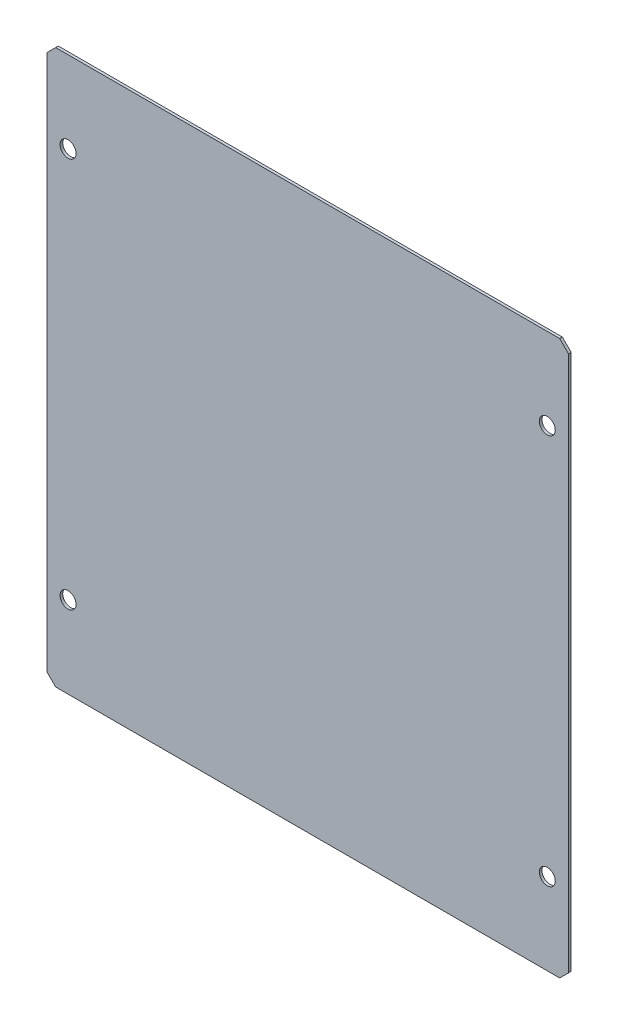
ISO-10303-21;
HEADER;
FILE_DESCRIPTION(('STEP AP214'),'2;1');
FILE_NAME('part.step','',(''),(''),'','','');
FILE_SCHEMA(('AUTOMOTIVE_DESIGN { 1 0 10303 214 1 1 1 1 }'));
ENDSEC;
DATA;
#1=APPLICATION_CONTEXT('core data for automotive mechanical design processes');
#2=APPLICATION_PROTOCOL_DEFINITION('international standard','automotive_design',2000,#1);
#3=PRODUCT_CONTEXT('',#1,'mechanical');
#4=PRODUCT('Part','Part','',(#3));
#5=PRODUCT_RELATED_PRODUCT_CATEGORY('part','',(#4));
#6=PRODUCT_DEFINITION_FORMATION('','',#4);
#7=PRODUCT_DEFINITION_CONTEXT('part definition',#1,'design');
#8=PRODUCT_DEFINITION('design','',#6,#7);
#9=PRODUCT_DEFINITION_SHAPE('','',#8);
#10=(LENGTH_UNIT() NAMED_UNIT(*) SI_UNIT(.MILLI.,.METRE.));
#11=(NAMED_UNIT(*) PLANE_ANGLE_UNIT() SI_UNIT($,.RADIAN.));
#12=(NAMED_UNIT(*) SI_UNIT($,.STERADIAN.) SOLID_ANGLE_UNIT());
#13=UNCERTAINTY_MEASURE_WITH_UNIT(LENGTH_MEASURE(1.E-05),#10,'distance_accuracy_value','');
#14=(GEOMETRIC_REPRESENTATION_CONTEXT(3) GLOBAL_UNCERTAINTY_ASSIGNED_CONTEXT((#13)) GLOBAL_UNIT_ASSIGNED_CONTEXT((#10,
#11,#12)) REPRESENTATION_CONTEXT('',''));
#15=CARTESIAN_POINT('',(0.,0.,0.));
#16=DIRECTION('',(0.,0.,1.));
#17=DIRECTION('',(1.,0.,0.));
#18=AXIS2_PLACEMENT_3D('',#15,#16,#17);
#19=CARTESIAN_POINT('',(0.,0.,1.5));
#20=DIRECTION('',(1.,0.,0.));
#21=DIRECTION('',(0.,0.,-1.));
#22=AXIS2_PLACEMENT_3D('',#19,#20,#21);
#23=PLANE('',#22);
#24=DIRECTION('',(0.,-1.,0.));
#25=VECTOR('',#24,1.);
#26=CARTESIAN_POINT('',(0.,0.,0.));
#27=LINE('',#26,#25);
#28=CARTESIAN_POINT('',(0.,307.,0.));
#29=VERTEX_POINT('',#28);
#30=CARTESIAN_POINT('',(0.,5.,0.));
#31=VERTEX_POINT('',#30);
#32=EDGE_CURVE('E133',#29,#31,#27,.T.);
#33=ORIENTED_EDGE('',*,*,#32,.T.);
#34=DIRECTION('',(0.,0.,1.));
#35=VECTOR('',#34,1.);
#36=CARTESIAN_POINT('',(0.,5.,1.5));
#37=LINE('',#36,#35);
#38=CARTESIAN_POINT('',(0.,5.,1.5));
#39=VERTEX_POINT('',#38);
#40=EDGE_CURVE('E11',#31,#39,#37,.T.);
#41=ORIENTED_EDGE('',*,*,#40,.T.);
#42=DIRECTION('',(0.,-1.,0.));
#43=VECTOR('',#42,1.);
#44=CARTESIAN_POINT('',(0.,0.,1.5));
#45=LINE('',#44,#43);
#46=CARTESIAN_POINT('',(0.,307.,1.5));
#47=VERTEX_POINT('',#46);
#48=EDGE_CURVE('E131',#47,#39,#45,.T.);
#49=ORIENTED_EDGE('',*,*,#48,.F.);
#50=DIRECTION('',(0.,0.,-1.));
#51=VECTOR('',#50,1.);
#52=CARTESIAN_POINT('',(0.,307.,1.5));
#53=LINE('',#52,#51);
#54=EDGE_CURVE('E45',#47,#29,#53,.T.);
#55=ORIENTED_EDGE('',*,*,#54,.T.);
#56=EDGE_LOOP('',(#33,#41,#49,#55));
#57=FACE_BOUND('',#56,.T.);
#58=ADVANCED_FACE('F37',(#57),#23,.F.);
#59=CARTESIAN_POINT('',(0.,0.,1.5));
#60=DIRECTION('',(0.,1.,0.));
#61=DIRECTION('',(0.,0.,1.));
#62=AXIS2_PLACEMENT_3D('',#59,#60,#61);
#63=PLANE('',#62);
#64=DIRECTION('',(1.,0.,0.));
#65=VECTOR('',#64,1.);
#66=CARTESIAN_POINT('',(0.,0.,0.));
#67=LINE('',#66,#65);
#68=CARTESIAN_POINT('',(5.,0.,0.));
#69=VERTEX_POINT('',#68);
#70=CARTESIAN_POINT('',(289.,0.,0.));
#71=VERTEX_POINT('',#70);
#72=EDGE_CURVE('E129',#69,#71,#67,.T.);
#73=ORIENTED_EDGE('',*,*,#72,.T.);
#74=DIRECTION('',(0.,0.,1.));
#75=VECTOR('',#74,1.);
#76=CARTESIAN_POINT('',(289.,0.,1.5));
#77=LINE('',#76,#75);
#78=CARTESIAN_POINT('',(289.,0.,1.5));
#79=VERTEX_POINT('',#78);
#80=EDGE_CURVE('E108',#71,#79,#77,.T.);
#81=ORIENTED_EDGE('',*,*,#80,.T.);
#82=DIRECTION('',(1.,0.,0.));
#83=VECTOR('',#82,1.);
#84=CARTESIAN_POINT('',(0.,0.,1.5));
#85=LINE('',#84,#83);
#86=CARTESIAN_POINT('',(5.,0.,1.5));
#87=VERTEX_POINT('',#86);
#88=EDGE_CURVE('E173',#87,#79,#85,.T.);
#89=ORIENTED_EDGE('',*,*,#88,.F.);
#90=DIRECTION('',(0.,0.,-1.));
#91=VECTOR('',#90,1.);
#92=CARTESIAN_POINT('',(5.,0.,1.5));
#93=LINE('',#92,#91);
#94=EDGE_CURVE('E113',#87,#69,#93,.T.);
#95=ORIENTED_EDGE('',*,*,#94,.T.);
#96=EDGE_LOOP('',(#73,#81,#89,#95));
#97=FACE_BOUND('',#96,.T.);
#98=ADVANCED_FACE('F221',(#97),#63,.F.);
#99=CARTESIAN_POINT('',(294.,0.,1.5));
#100=DIRECTION('',(-1.,0.,0.));
#101=DIRECTION('',(0.,0.,1.));
#102=AXIS2_PLACEMENT_3D('',#99,#100,#101);
#103=PLANE('',#102);
#104=DIRECTION('',(0.,1.,0.));
#105=VECTOR('',#104,1.);
#106=CARTESIAN_POINT('',(294.,0.,1.5));
#107=LINE('',#106,#105);
#108=CARTESIAN_POINT('',(294.,5.,1.5));
#109=VERTEX_POINT('',#108);
#110=CARTESIAN_POINT('',(294.,307.,1.5));
#111=VERTEX_POINT('',#110);
#112=EDGE_CURVE('E122',#109,#111,#107,.T.);
#113=ORIENTED_EDGE('',*,*,#112,.F.);
#114=DIRECTION('',(0.,0.,-1.));
#115=VECTOR('',#114,1.);
#116=CARTESIAN_POINT('',(294.,5.,1.5));
#117=LINE('',#116,#115);
#118=CARTESIAN_POINT('',(294.,5.,0.));
#119=VERTEX_POINT('',#118);
#120=EDGE_CURVE('E107',#109,#119,#117,.T.);
#121=ORIENTED_EDGE('',*,*,#120,.T.);
#122=DIRECTION('',(0.,1.,0.));
#123=VECTOR('',#122,1.);
#124=CARTESIAN_POINT('',(294.,0.,0.));
#125=LINE('',#124,#123);
#126=CARTESIAN_POINT('',(294.,307.,0.));
#127=VERTEX_POINT('',#126);
#128=EDGE_CURVE('E120',#119,#127,#125,.T.);
#129=ORIENTED_EDGE('',*,*,#128,.T.);
#130=DIRECTION('',(0.,0.,1.));
#131=VECTOR('',#130,1.);
#132=CARTESIAN_POINT('',(294.,307.,1.5));
#133=LINE('',#132,#131);
#134=EDGE_CURVE('E124',#127,#111,#133,.T.);
#135=ORIENTED_EDGE('',*,*,#134,.T.);
#136=EDGE_LOOP('',(#113,#121,#129,#135));
#137=FACE_BOUND('',#136,.T.);
#138=ADVANCED_FACE('F119',(#137),#103,.F.);
#139=CARTESIAN_POINT('',(0.,312.,1.5));
#140=DIRECTION('',(0.,-1.,0.));
#141=DIRECTION('',(0.,0.,-1.));
#142=AXIS2_PLACEMENT_3D('',#139,#140,#141);
#143=PLANE('',#142);
#144=DIRECTION('',(-1.,0.,0.));
#145=VECTOR('',#144,1.);
#146=CARTESIAN_POINT('',(0.,312.,1.5));
#147=LINE('',#146,#145);
#148=CARTESIAN_POINT('',(289.,312.,1.5));
#149=VERTEX_POINT('',#148);
#150=CARTESIAN_POINT('',(4.99999999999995,312.,1.5));
#151=VERTEX_POINT('',#150);
#152=EDGE_CURVE('E141',#149,#151,#147,.T.);
#153=ORIENTED_EDGE('',*,*,#152,.F.);
#154=DIRECTION('',(0.,0.,-1.));
#155=VECTOR('',#154,1.);
#156=CARTESIAN_POINT('',(289.,312.,1.5));
#157=LINE('',#156,#155);
#158=CARTESIAN_POINT('',(289.,312.,0.));
#159=VERTEX_POINT('',#158);
#160=EDGE_CURVE('E158',#149,#159,#157,.T.);
#161=ORIENTED_EDGE('',*,*,#160,.T.);
#162=DIRECTION('',(-1.,0.,0.));
#163=VECTOR('',#162,1.);
#164=CARTESIAN_POINT('',(0.,312.,0.));
#165=LINE('',#164,#163);
#166=CARTESIAN_POINT('',(4.99999999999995,312.,0.));
#167=VERTEX_POINT('',#166);
#168=EDGE_CURVE('E128',#159,#167,#165,.T.);
#169=ORIENTED_EDGE('',*,*,#168,.T.);
#170=DIRECTION('',(0.,0.,1.));
#171=VECTOR('',#170,1.);
#172=CARTESIAN_POINT('',(4.99999999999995,312.,1.5));
#173=LINE('',#172,#171);
#174=EDGE_CURVE('E52',#167,#151,#173,.T.);
#175=ORIENTED_EDGE('',*,*,#174,.T.);
#176=EDGE_LOOP('',(#153,#161,#169,#175));
#177=FACE_BOUND('',#176,.T.);
#178=ADVANCED_FACE('F210',(#177),#143,.F.);
#179=CARTESIAN_POINT('',(0.,0.,1.5));
#180=DIRECTION('',(0.,0.,-1.));
#181=DIRECTION('',(-1.,0.,0.));
#182=AXIS2_PLACEMENT_3D('',#179,#180,#181);
#183=PLANE('',#182);
#184=CARTESIAN_POINT('',(12.,266.,1.5));
#185=DIRECTION('',(0.,0.,-1.));
#186=DIRECTION('',(-1.,0.,0.));
#187=AXIS2_PLACEMENT_3D('',#184,#185,#186);
#188=CIRCLE('',#187,4.5);
#189=CARTESIAN_POINT('',(7.49999999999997,266.,1.5));
#190=VERTEX_POINT('',#189);
#191=EDGE_CURVE('E191',#190,#190,#188,.T.);
#192=ORIENTED_EDGE('',*,*,#191,.T.);
#193=EDGE_LOOP('',(#192));
#194=FACE_BOUND('',#193,.T.);
#195=CARTESIAN_POINT('',(12.,46.,1.5));
#196=DIRECTION('',(0.,0.,-1.));
#197=DIRECTION('',(-1.,0.,0.));
#198=AXIS2_PLACEMENT_3D('',#195,#196,#197);
#199=CIRCLE('',#198,4.5);
#200=CARTESIAN_POINT('',(7.49999999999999,46.,1.5));
#201=VERTEX_POINT('',#200);
#202=EDGE_CURVE('E185',#201,#201,#199,.T.);
#203=ORIENTED_EDGE('',*,*,#202,.T.);
#204=EDGE_LOOP('',(#203));
#205=FACE_BOUND('',#204,.T.);
#206=CARTESIAN_POINT('',(282.,266.,1.5));
#207=DIRECTION('',(0.,0.,-1.));
#208=DIRECTION('',(-1.,0.,0.));
#209=AXIS2_PLACEMENT_3D('',#206,#207,#208);
#210=CIRCLE('',#209,4.5);
#211=CARTESIAN_POINT('',(277.5,266.,1.5));
#212=VERTEX_POINT('',#211);
#213=EDGE_CURVE('E179',#212,#212,#210,.T.);
#214=ORIENTED_EDGE('',*,*,#213,.T.);
#215=EDGE_LOOP('',(#214));
#216=FACE_BOUND('',#215,.T.);
#217=CARTESIAN_POINT('',(282.,46.,1.5));
#218=DIRECTION('',(0.,0.,-1.));
#219=DIRECTION('',(-1.,0.,0.));
#220=AXIS2_PLACEMENT_3D('',#217,#218,#219);
#221=CIRCLE('',#220,4.5);
#222=CARTESIAN_POINT('',(277.5,46.,1.5));
#223=VERTEX_POINT('',#222);
#224=EDGE_CURVE('E137',#223,#223,#221,.T.);
#225=ORIENTED_EDGE('',*,*,#224,.T.);
#226=EDGE_LOOP('',(#225));
#227=FACE_BOUND('',#226,.T.);
#228=ORIENTED_EDGE('',*,*,#88,.T.);
#229=DIRECTION('',(-0.707106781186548,-0.707106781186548,0.));
#230=VECTOR('',#229,1.);
#231=CARTESIAN_POINT('',(294.,5.,1.5));
#232=LINE('',#231,#230);
#233=EDGE_CURVE('E155',#79,#109,#232,.F.);
#234=ORIENTED_EDGE('',*,*,#233,.T.);
#235=ORIENTED_EDGE('',*,*,#112,.T.);
#236=DIRECTION('',(0.707106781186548,-0.707106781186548,0.));
#237=VECTOR('',#236,1.);
#238=CARTESIAN_POINT('',(289.,312.,1.5));
#239=LINE('',#238,#237);
#240=EDGE_CURVE('E59',#111,#149,#239,.F.);
#241=ORIENTED_EDGE('',*,*,#240,.T.);
#242=ORIENTED_EDGE('',*,*,#152,.T.);
#243=DIRECTION('',(0.707106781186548,0.707106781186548,0.));
#244=VECTOR('',#243,1.);
#245=CARTESIAN_POINT('',(0.,307.,1.5));
#246=LINE('',#245,#244);
#247=EDGE_CURVE('E150',#151,#47,#246,.F.);
#248=ORIENTED_EDGE('',*,*,#247,.T.);
#249=ORIENTED_EDGE('',*,*,#48,.T.);
#250=DIRECTION('',(-0.707106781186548,0.707106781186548,0.));
#251=VECTOR('',#250,1.);
#252=CARTESIAN_POINT('',(5.,0.,1.5));
#253=LINE('',#252,#251);
#254=EDGE_CURVE('E152',#39,#87,#253,.F.);
#255=ORIENTED_EDGE('',*,*,#254,.T.);
#256=EDGE_LOOP('',(#228,#234,#235,#241,#242,#248,#249,#255));
#257=FACE_BOUND('',#256,.T.);
#258=ADVANCED_FACE('F207',(#194,#205,#216,#227,#257),#183,.F.);
#259=CARTESIAN_POINT('',(0.,0.,0.));
#260=DIRECTION('',(0.,0.,-1.));
#261=DIRECTION('',(-1.,0.,0.));
#262=AXIS2_PLACEMENT_3D('',#259,#260,#261);
#263=PLANE('',#262);
#264=CARTESIAN_POINT('',(12.,266.,0.));
#265=DIRECTION('',(0.,0.,1.));
#266=DIRECTION('',(1.,0.,0.));
#267=AXIS2_PLACEMENT_3D('',#264,#265,#266);
#268=CIRCLE('',#267,4.5);
#269=CARTESIAN_POINT('',(16.5,266.,0.));
#270=VERTEX_POINT('',#269);
#271=EDGE_CURVE('E194',#270,#270,#268,.T.);
#272=ORIENTED_EDGE('',*,*,#271,.T.);
#273=EDGE_LOOP('',(#272));
#274=FACE_BOUND('',#273,.T.);
#275=CARTESIAN_POINT('',(12.,46.,0.));
#276=DIRECTION('',(0.,0.,1.));
#277=DIRECTION('',(1.,0.,0.));
#278=AXIS2_PLACEMENT_3D('',#275,#276,#277);
#279=CIRCLE('',#278,4.5);
#280=CARTESIAN_POINT('',(16.5,46.,0.));
#281=VERTEX_POINT('',#280);
#282=EDGE_CURVE('E188',#281,#281,#279,.T.);
#283=ORIENTED_EDGE('',*,*,#282,.T.);
#284=EDGE_LOOP('',(#283));
#285=FACE_BOUND('',#284,.T.);
#286=CARTESIAN_POINT('',(282.,266.,0.));
#287=DIRECTION('',(0.,0.,1.));
#288=DIRECTION('',(1.,0.,0.));
#289=AXIS2_PLACEMENT_3D('',#286,#287,#288);
#290=CIRCLE('',#289,4.5);
#291=CARTESIAN_POINT('',(286.5,266.,0.));
#292=VERTEX_POINT('',#291);
#293=EDGE_CURVE('E182',#292,#292,#290,.T.);
#294=ORIENTED_EDGE('',*,*,#293,.T.);
#295=EDGE_LOOP('',(#294));
#296=FACE_BOUND('',#295,.T.);
#297=CARTESIAN_POINT('',(282.,46.,0.));
#298=DIRECTION('',(0.,0.,1.));
#299=DIRECTION('',(1.,0.,0.));
#300=AXIS2_PLACEMENT_3D('',#297,#298,#299);
#301=CIRCLE('',#300,4.5);
#302=CARTESIAN_POINT('',(286.5,46.,0.));
#303=VERTEX_POINT('',#302);
#304=EDGE_CURVE('E140',#303,#303,#301,.T.);
#305=ORIENTED_EDGE('',*,*,#304,.T.);
#306=EDGE_LOOP('',(#305));
#307=FACE_BOUND('',#306,.T.);
#308=ORIENTED_EDGE('',*,*,#128,.F.);
#309=DIRECTION('',(0.707106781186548,0.707106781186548,0.));
#310=VECTOR('',#309,1.);
#311=CARTESIAN_POINT('',(144.5,-144.5,0.));
#312=LINE('',#311,#310);
#313=EDGE_CURVE('E103',#119,#71,#312,.F.);
#314=ORIENTED_EDGE('',*,*,#313,.T.);
#315=ORIENTED_EDGE('',*,*,#72,.F.);
#316=DIRECTION('',(0.707106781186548,-0.707106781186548,0.));
#317=VECTOR('',#316,1.);
#318=CARTESIAN_POINT('',(2.5,2.5,0.));
#319=LINE('',#318,#317);
#320=EDGE_CURVE('E144',#69,#31,#319,.F.);
#321=ORIENTED_EDGE('',*,*,#320,.T.);
#322=ORIENTED_EDGE('',*,*,#32,.F.);
#323=DIRECTION('',(-0.707106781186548,-0.707106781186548,0.));
#324=VECTOR('',#323,1.);
#325=CARTESIAN_POINT('',(-153.5,153.5,0.));
#326=LINE('',#325,#324);
#327=EDGE_CURVE('E123',#29,#167,#326,.F.);
#328=ORIENTED_EDGE('',*,*,#327,.T.);
#329=ORIENTED_EDGE('',*,*,#168,.F.);
#330=DIRECTION('',(-0.707106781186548,0.707106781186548,0.));
#331=VECTOR('',#330,1.);
#332=CARTESIAN_POINT('',(300.5,300.5,0.));
#333=LINE('',#332,#331);
#334=EDGE_CURVE('E114',#159,#127,#333,.F.);
#335=ORIENTED_EDGE('',*,*,#334,.T.);
#336=EDGE_LOOP('',(#308,#314,#315,#321,#322,#328,#329,#335));
#337=FACE_BOUND('',#336,.T.);
#338=ADVANCED_FACE('F126',(#274,#285,#296,#307,#337),#263,.T.);
#339=CARTESIAN_POINT('',(282.,46.,1.5));
#340=DIRECTION('',(0.,0.,1.));
#341=DIRECTION('',(1.,0.,0.));
#342=AXIS2_PLACEMENT_3D('',#339,#340,#341);
#343=CYLINDRICAL_SURFACE('',#342,4.5);
#344=ORIENTED_EDGE('',*,*,#304,.F.);
#345=EDGE_LOOP('',(#344));
#346=FACE_BOUND('',#345,.T.);
#347=ORIENTED_EDGE('',*,*,#224,.F.);
#348=EDGE_LOOP('',(#347));
#349=FACE_BOUND('',#348,.T.);
#350=ADVANCED_FACE('F251',(#346,#349),#343,.F.);
#351=CARTESIAN_POINT('',(282.,266.,1.5));
#352=DIRECTION('',(0.,0.,1.));
#353=DIRECTION('',(1.,0.,0.));
#354=AXIS2_PLACEMENT_3D('',#351,#352,#353);
#355=CYLINDRICAL_SURFACE('',#354,4.5);
#356=ORIENTED_EDGE('',*,*,#293,.F.);
#357=EDGE_LOOP('',(#356));
#358=FACE_BOUND('',#357,.T.);
#359=ORIENTED_EDGE('',*,*,#213,.F.);
#360=EDGE_LOOP('',(#359));
#361=FACE_BOUND('',#360,.T.);
#362=ADVANCED_FACE('F255',(#358,#361),#355,.F.);
#363=CARTESIAN_POINT('',(12.,46.,1.5));
#364=DIRECTION('',(0.,0.,1.));
#365=DIRECTION('',(1.,0.,0.));
#366=AXIS2_PLACEMENT_3D('',#363,#364,#365);
#367=CYLINDRICAL_SURFACE('',#366,4.5);
#368=ORIENTED_EDGE('',*,*,#282,.F.);
#369=EDGE_LOOP('',(#368));
#370=FACE_BOUND('',#369,.T.);
#371=ORIENTED_EDGE('',*,*,#202,.F.);
#372=EDGE_LOOP('',(#371));
#373=FACE_BOUND('',#372,.T.);
#374=ADVANCED_FACE('F203',(#370,#373),#367,.F.);
#375=CARTESIAN_POINT('',(12.,266.,1.5));
#376=DIRECTION('',(0.,0.,1.));
#377=DIRECTION('',(1.,0.,0.));
#378=AXIS2_PLACEMENT_3D('',#375,#376,#377);
#379=CYLINDRICAL_SURFACE('',#378,4.5);
#380=ORIENTED_EDGE('',*,*,#271,.F.);
#381=EDGE_LOOP('',(#380));
#382=FACE_BOUND('',#381,.T.);
#383=ORIENTED_EDGE('',*,*,#191,.F.);
#384=EDGE_LOOP('',(#383));
#385=FACE_BOUND('',#384,.T.);
#386=ADVANCED_FACE('F200',(#382,#385),#379,.F.);
#387=CARTESIAN_POINT('',(294.,5.,1.5));
#388=DIRECTION('',(-0.707106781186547,0.707106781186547,0.));
#389=DIRECTION('',(0.,0.,-1.));
#390=AXIS2_PLACEMENT_3D('',#387,#388,#389);
#391=PLANE('',#390);
#392=ORIENTED_EDGE('',*,*,#233,.F.);
#393=ORIENTED_EDGE('',*,*,#80,.F.);
#394=ORIENTED_EDGE('',*,*,#313,.F.);
#395=ORIENTED_EDGE('',*,*,#120,.F.);
#396=EDGE_LOOP('',(#392,#393,#394,#395));
#397=FACE_BOUND('',#396,.T.);
#398=ADVANCED_FACE('F106',(#397),#391,.F.);
#399=CARTESIAN_POINT('',(289.,312.,1.5));
#400=DIRECTION('',(-0.707106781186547,-0.707106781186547,0.));
#401=DIRECTION('',(0.,0.,-1.));
#402=AXIS2_PLACEMENT_3D('',#399,#400,#401);
#403=PLANE('',#402);
#404=ORIENTED_EDGE('',*,*,#240,.F.);
#405=ORIENTED_EDGE('',*,*,#134,.F.);
#406=ORIENTED_EDGE('',*,*,#334,.F.);
#407=ORIENTED_EDGE('',*,*,#160,.F.);
#408=EDGE_LOOP('',(#404,#405,#406,#407));
#409=FACE_BOUND('',#408,.T.);
#410=ADVANCED_FACE('F228',(#409),#403,.F.);
#411=CARTESIAN_POINT('',(5.,0.,1.5));
#412=DIRECTION('',(0.707106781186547,0.707106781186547,0.));
#413=DIRECTION('',(0.,0.,-1.));
#414=AXIS2_PLACEMENT_3D('',#411,#412,#413);
#415=PLANE('',#414);
#416=ORIENTED_EDGE('',*,*,#254,.F.);
#417=ORIENTED_EDGE('',*,*,#40,.F.);
#418=ORIENTED_EDGE('',*,*,#320,.F.);
#419=ORIENTED_EDGE('',*,*,#94,.F.);
#420=EDGE_LOOP('',(#416,#417,#418,#419));
#421=FACE_BOUND('',#420,.T.);
#422=ADVANCED_FACE('F223',(#421),#415,.F.);
#423=CARTESIAN_POINT('',(0.,307.,1.5));
#424=DIRECTION('',(0.707106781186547,-0.707106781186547,0.));
#425=DIRECTION('',(0.,0.,-1.));
#426=AXIS2_PLACEMENT_3D('',#423,#424,#425);
#427=PLANE('',#426);
#428=ORIENTED_EDGE('',*,*,#247,.F.);
#429=ORIENTED_EDGE('',*,*,#174,.F.);
#430=ORIENTED_EDGE('',*,*,#327,.F.);
#431=ORIENTED_EDGE('',*,*,#54,.F.);
#432=EDGE_LOOP('',(#428,#429,#430,#431));
#433=FACE_BOUND('',#432,.T.);
#434=ADVANCED_FACE('F39',(#433),#427,.F.);
#435=CLOSED_SHELL('',(#58,#98,#138,#178,#258,#338,#350,#362,#374,#386,#398,#410,#422,#434));
#436=MANIFOLD_SOLID_BREP('B2',#435);
#437=ADVANCED_BREP_SHAPE_REPRESENTATION('',(#18,#436),#14);
#438=SHAPE_DEFINITION_REPRESENTATION(#9,#437);
ENDSEC;
END-ISO-10303-21;
